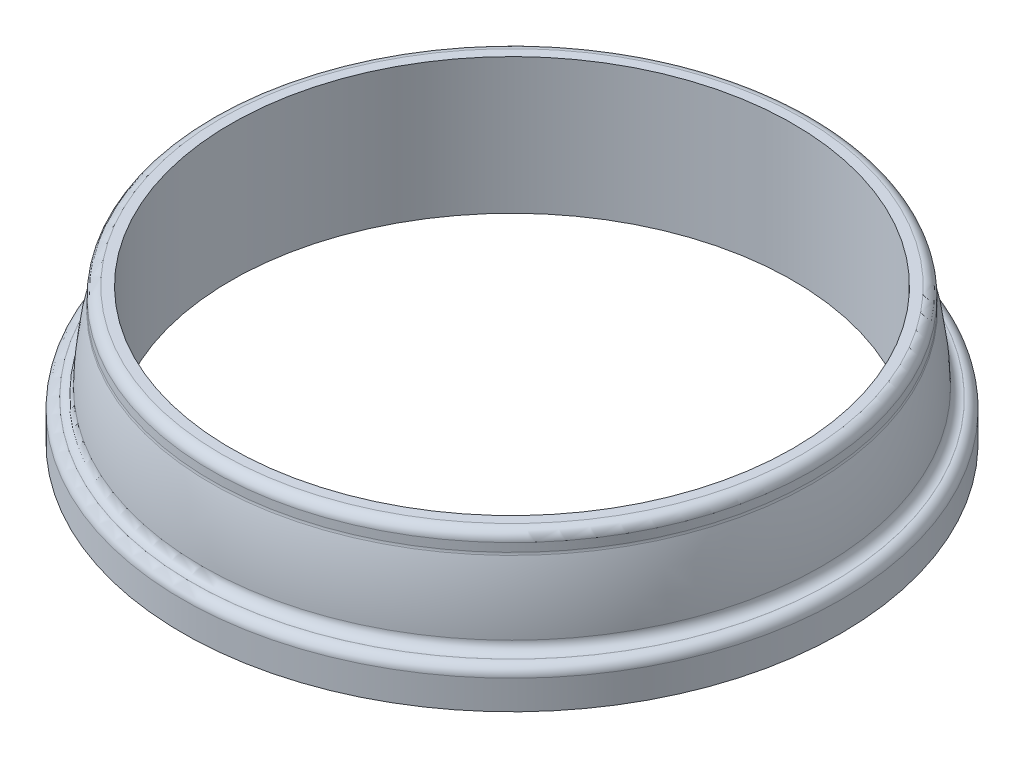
from build123d import *

# Parameters (mm, degrees)
REDONDEO1_R = 0.5


with BuildPart() as part:
    # Croquis1 → Revoluci_n1 (revolve)
    with BuildSketch(Plane.XY):
        with BuildLine():
            Line((17, 0), (17, 2))
            Line((17, 2), (16, 2))
            ThreePointArc((16, 2), (15.884983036, 4.01687288), (15.5, 6))
            Line((15.5, 6), (15.5, 7))
            Line((15.5, 7), (14.5, 7))
            Line((14.5, 7), (14.5, 0))
            Line((14.5, 0), (17, 0))
        make_face()
    revolve(axis=Axis((0, 0, 0), (0, 1, 0)))

    # Redondeo1
    redondeo1_edges = [part.edges().sort_by_distance(p)[0] for p in [
        (-17, 2, 0),
        (-16, 2, 0),
        (-15.5, 6, 0),
        (-15.5, 7, 0),
    ]]
    fillet(redondeo1_edges, radius=REDONDEO1_R)


solid = part.part
